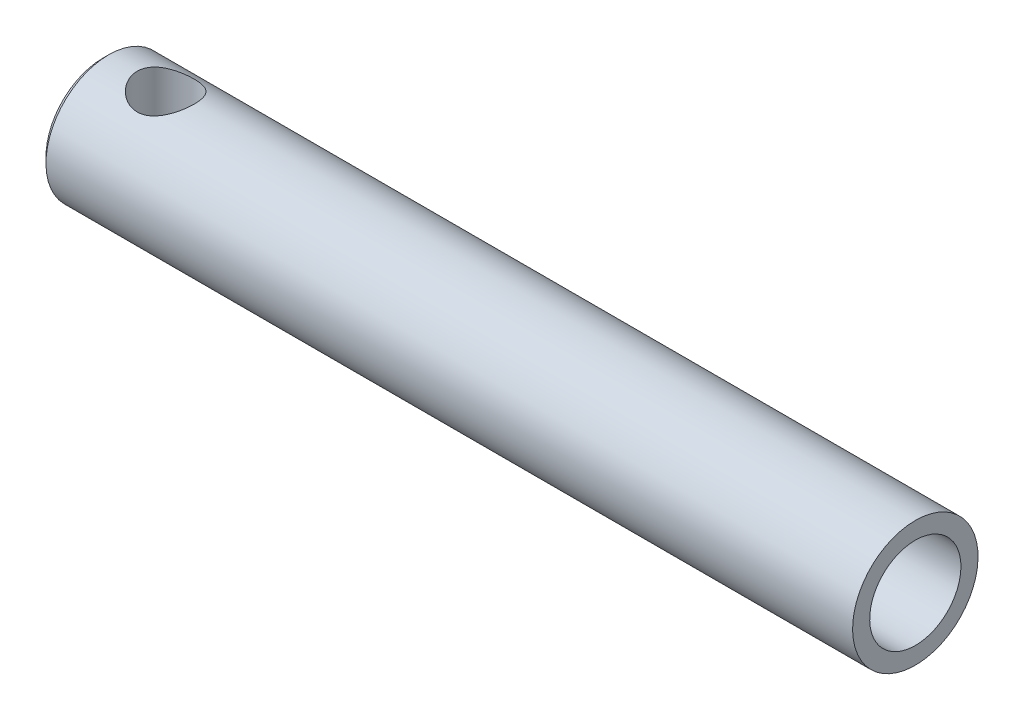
ISO-10303-21;
HEADER;
FILE_DESCRIPTION(('STEP AP214'),'2;1');
FILE_NAME('part.step','',(''),(''),'','','');
FILE_SCHEMA(('AUTOMOTIVE_DESIGN { 1 0 10303 214 1 1 1 1 }'));
ENDSEC;
DATA;
#1=APPLICATION_CONTEXT('core data for automotive mechanical design processes');
#2=APPLICATION_PROTOCOL_DEFINITION('international standard','automotive_design',2000,#1);
#3=PRODUCT_CONTEXT('',#1,'mechanical');
#4=PRODUCT('Part','Part','',(#3));
#5=PRODUCT_RELATED_PRODUCT_CATEGORY('part','',(#4));
#6=PRODUCT_DEFINITION_FORMATION('','',#4);
#7=PRODUCT_DEFINITION_CONTEXT('part definition',#1,'design');
#8=PRODUCT_DEFINITION('design','',#6,#7);
#9=PRODUCT_DEFINITION_SHAPE('','',#8);
#10=(LENGTH_UNIT() NAMED_UNIT(*) SI_UNIT(.MILLI.,.METRE.));
#11=(NAMED_UNIT(*) PLANE_ANGLE_UNIT() SI_UNIT($,.RADIAN.));
#12=(NAMED_UNIT(*) SI_UNIT($,.STERADIAN.) SOLID_ANGLE_UNIT());
#13=UNCERTAINTY_MEASURE_WITH_UNIT(LENGTH_MEASURE(1.E-05),#10,'distance_accuracy_value','');
#14=(GEOMETRIC_REPRESENTATION_CONTEXT(3) GLOBAL_UNCERTAINTY_ASSIGNED_CONTEXT((#13)) GLOBAL_UNIT_ASSIGNED_CONTEXT((#10,
#11,#12)) REPRESENTATION_CONTEXT('',''));
#15=CARTESIAN_POINT('',(0.,0.,0.));
#16=DIRECTION('',(0.,0.,1.));
#17=DIRECTION('',(1.,0.,0.));
#18=AXIS2_PLACEMENT_3D('',#15,#16,#17);
#19=CARTESIAN_POINT('',(-21.0563492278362,0.,0.));
#20=DIRECTION('',(1.,0.,0.));
#21=DIRECTION('',(0.,1.,0.));
#22=AXIS2_PLACEMENT_3D('',#19,#20,#21);
#23=CYLINDRICAL_SURFACE('',#22,5.5);
#24=CARTESIAN_POINT('',(-5.00000004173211,0.,0.));
#25=DIRECTION('',(1.,0.,0.));
#26=DIRECTION('',(0.,1.,0.));
#27=AXIS2_PLACEMENT_3D('',#24,#25,#26);
#28=CIRCLE('',#27,5.5);
#29=CARTESIAN_POINT('',(-5.00000004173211,5.5,0.));
#30=VERTEX_POINT('',#29);
#31=EDGE_CURVE('E23',#30,#30,#28,.T.);
#32=ORIENTED_EDGE('',*,*,#31,.T.);
#33=EDGE_LOOP('',(#32));
#34=FACE_BOUND('',#33,.T.);
#35=CARTESIAN_POINT('',(0.,-4.89897948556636,2.5));
#36=CARTESIAN_POINT('',(0.13201451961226,-4.89898837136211,2.49999196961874));
#37=CARTESIAN_POINT('',(0.26423901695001,-4.90439430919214,2.48947537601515));
#38=CARTESIAN_POINT('',(0.524765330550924,-4.92528154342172,2.44787943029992));
#39=CARTESIAN_POINT('',(0.653056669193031,-4.94078765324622,2.41674943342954));
#40=CARTESIAN_POINT('',(0.901476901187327,-4.97972515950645,2.33545276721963));
#41=CARTESIAN_POINT('',(1.02164042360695,-5.00312000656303,2.28537376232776));
#42=CARTESIAN_POINT('',(1.25183023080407,-5.05514370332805,2.16786451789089));
#43=CARTESIAN_POINT('',(1.36185758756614,-5.08377199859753,2.10043611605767));
#44=CARTESIAN_POINT('',(1.57689426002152,-5.14541251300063,1.9447848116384));
#45=CARTESIAN_POINT('',(1.68106246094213,-5.17859023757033,1.85546486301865));
#46=CARTESIAN_POINT('',(1.87357655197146,-5.24424327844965,1.66086013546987));
#47=CARTESIAN_POINT('',(1.96191562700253,-5.27671828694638,1.55556851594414));
#48=CARTESIAN_POINT('',(2.12485113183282,-5.33938487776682,1.32512405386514));
#49=CARTESIAN_POINT('',(2.19846269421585,-5.3693621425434,1.19921119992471));
#50=CARTESIAN_POINT('',(2.32308499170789,-5.42157820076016,0.935175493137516));
#51=CARTESIAN_POINT('',(2.37410757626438,-5.44382105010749,0.797059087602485));
#52=CARTESIAN_POINT('',(2.44893433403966,-5.47688079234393,0.521404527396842));
#53=CARTESIAN_POINT('',(2.47419949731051,-5.48830796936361,0.384337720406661));
#54=CARTESIAN_POINT('',(2.50155448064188,-5.5006923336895,0.107467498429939));
#55=CARTESIAN_POINT('',(2.5036556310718,-5.50165463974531,-0.0323345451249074));
#56=CARTESIAN_POINT('',(2.4853019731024,-5.493330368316,-0.299930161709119));
#57=CARTESIAN_POINT('',(2.46646426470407,-5.48477852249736,-0.427862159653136));
#58=CARTESIAN_POINT('',(2.40959213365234,-5.45944031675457,-0.678516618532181));
#59=CARTESIAN_POINT('',(2.37155628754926,-5.44265334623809,-0.801238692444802));
#60=CARTESIAN_POINT('',(2.27697996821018,-5.40210986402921,-1.04025925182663));
#61=CARTESIAN_POINT('',(2.22016820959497,-5.37825173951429,-1.15643244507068));
#62=CARTESIAN_POINT('',(2.08995466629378,-5.32582034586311,-1.37789997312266));
#63=CARTESIAN_POINT('',(2.016546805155,-5.29724535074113,-1.48319030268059));
#64=CARTESIAN_POINT('',(1.84830048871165,-5.23541847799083,-1.68904292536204));
#65=CARTESIAN_POINT('',(1.75220270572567,-5.20197523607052,-1.78851976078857));
#66=CARTESIAN_POINT('',(1.54476575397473,-5.13581955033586,-1.97046933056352));
#67=CARTESIAN_POINT('',(1.43341836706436,-5.10310751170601,-2.05293283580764));
#68=CARTESIAN_POINT('',(1.1923801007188,-5.04059957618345,-2.20209013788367));
#69=CARTESIAN_POINT('',(1.06208750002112,-5.01100237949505,-2.26790243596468));
#70=CARTESIAN_POINT('',(0.790579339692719,-4.9605759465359,-2.37619334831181));
#71=CARTESIAN_POINT('',(0.649373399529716,-4.93973909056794,-2.41869225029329));
#72=CARTESIAN_POINT('',(0.370943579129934,-4.91119669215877,-2.47610787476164));
#73=CARTESIAN_POINT('',(0.234175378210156,-4.90264732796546,-2.49280372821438));
#74=CARTESIAN_POINT('',(-0.0404465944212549,-4.89722669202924,-2.50344178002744));
#75=CARTESIAN_POINT('',(-0.178299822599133,-4.90034990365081,-2.49739472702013));
#76=CARTESIAN_POINT('',(-0.43913653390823,-4.91703840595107,-2.46434845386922));
#77=CARTESIAN_POINT('',(-0.562408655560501,-4.92972117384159,-2.43911853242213));
#78=CARTESIAN_POINT('',(-0.8028151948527,-4.96289406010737,-2.3708881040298));
#79=CARTESIAN_POINT('',(-0.919947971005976,-4.98338625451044,-2.32788287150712));
#80=CARTESIAN_POINT('',(-1.15073047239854,-5.03098751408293,-2.2231964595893));
#81=CARTESIAN_POINT('',(-1.26398074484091,-5.05835471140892,-2.16075614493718));
#82=CARTESIAN_POINT('',(-1.47899920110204,-5.11631673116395,-2.01968175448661));
#83=CARTESIAN_POINT('',(-1.58076181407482,-5.1469131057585,-1.94103987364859));
#84=CARTESIAN_POINT('',(-1.7805626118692,-5.21158189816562,-1.76053571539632));
#85=CARTESIAN_POINT('',(-1.87720446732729,-5.24569526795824,-1.6571358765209));
#86=CARTESIAN_POINT('',(-2.05209822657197,-5.31079182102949,-1.4348829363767));
#87=CARTESIAN_POINT('',(-2.13034698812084,-5.34177446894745,-1.31602720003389));
#88=CARTESIAN_POINT('',(-2.26679496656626,-5.39763225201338,-1.06412926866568));
#89=CARTESIAN_POINT('',(-2.3247603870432,-5.42243527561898,-0.930943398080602));
#90=CARTESIAN_POINT('',(-2.41696091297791,-5.462596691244,-0.655271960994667));
#91=CARTESIAN_POINT('',(-2.45121311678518,-5.47796188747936,-0.512793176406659));
#92=CARTESIAN_POINT('',(-2.49257517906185,-5.49660137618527,-0.234932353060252));
#93=CARTESIAN_POINT('',(-2.50164338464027,-5.50074734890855,-0.0998989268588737));
#94=CARTESIAN_POINT('',(-2.4978682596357,-5.49903067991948,0.169779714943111));
#95=CARTESIAN_POINT('',(-2.48503020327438,-5.49317044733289,0.304425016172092));
#96=CARTESIAN_POINT('',(-2.43919443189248,-5.47259382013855,0.562783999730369));
#97=CARTESIAN_POINT('',(-2.40719214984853,-5.45831522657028,0.686712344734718));
#98=CARTESIAN_POINT('',(-2.32512996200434,-5.42262556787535,0.927328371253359));
#99=CARTESIAN_POINT('',(-2.275066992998,-5.40121329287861,1.04401482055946));
#100=CARTESIAN_POINT('',(-2.15580272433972,-5.35204671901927,1.27275603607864));
#101=CARTESIAN_POINT('',(-2.08583089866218,-5.32404717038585,1.3843549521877));
#102=CARTESIAN_POINT('',(-1.92977917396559,-5.26486798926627,1.59471801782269));
#103=CARTESIAN_POINT('',(-1.84369223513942,-5.23368696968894,1.693476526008));
#104=CARTESIAN_POINT('',(-1.64951149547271,-5.16835233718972,1.88390274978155));
#105=CARTESIAN_POINT('',(-1.5401866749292,-5.13416609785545,1.9743091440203));
#106=CARTESIAN_POINT('',(-1.30709433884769,-5.06911813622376,2.13579923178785));
#107=CARTESIAN_POINT('',(-1.18331737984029,-5.03825861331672,2.20687018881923));
#108=CARTESIAN_POINT('',(-0.922931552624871,-4.98353191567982,2.32785313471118));
#109=CARTESIAN_POINT('',(-0.786228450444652,-4.95972231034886,2.37759232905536));
#110=CARTESIAN_POINT('',(-0.575599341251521,-4.93218350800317,2.43392297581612));
#111=CARTESIAN_POINT('',(-0.504529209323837,-4.92436998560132,2.4496473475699));
#112=CARTESIAN_POINT('',(-0.361045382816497,-4.91174811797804,2.47486081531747));
#113=CARTESIAN_POINT('',(-0.288632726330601,-4.90693754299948,2.48435453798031));
#114=CARTESIAN_POINT('',(-0.180023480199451,-4.90215466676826,2.49377025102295));
#115=CARTESIAN_POINT('',(-0.144070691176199,-4.9009659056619,2.49610476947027));
#116=CARTESIAN_POINT('',(-0.0720838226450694,-4.89937708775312,2.49922076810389));
#117=CARTESIAN_POINT('',(-0.0360497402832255,-4.89897705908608,2.50000219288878));
#118=CARTESIAN_POINT('',(0.,-4.89897948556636,2.5));
#119=B_SPLINE_CURVE_WITH_KNOTS('',3,(#35,#36,#37,#38,#39,#40,#41,#42,#43,#44,#45,#46,#47,#48,
#49,#50,#51,#52,#53,#54,#55,#56,#57,#58,#59,#60,#61,#62,#63,#64,#65,#66,#67,#68,#69,#70,#71,#72,
#73,#74,#75,#76,#77,#78,#79,#80,#81,#82,#83,#84,#85,#86,#87,#88,#89,#90,#91,#92,#93,#94,#95,#96,
#97,#98,#99,#100,#101,#102,#103,#104,#105,#106,#107,#108,#109,#110,#111,#112,#113,#114,#115,
#116,#117,#118),.UNSPECIFIED.,.T.,.F.,(4,2,2,2,2,2,2,2,2,2,2,2,2,2,2,2,2,2,2,2,2,2,2,2,2,2,2,2,
2,2,2,2,2,2,2,2,2,2,2,2,2,4),(0.,0.395898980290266,0.792774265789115,1.18783548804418,
1.58285488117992,2.00455964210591,2.4264455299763,2.87084384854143,3.3150087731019,
3.73227994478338,4.14934700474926,4.53631095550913,4.92330360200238,5.31615183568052,
5.70914413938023,6.13417892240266,6.55944366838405,7.00393462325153,7.44803815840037,
7.85988595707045,8.27153913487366,8.64923866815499,9.02703867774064,9.42198794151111,
9.81712791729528,10.2518845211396,10.6867153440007,11.1264048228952,11.5657769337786,
11.9698739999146,12.3738737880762,12.7585157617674,13.1432230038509,13.5455235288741,
13.9480002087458,14.3837526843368,14.8197915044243,15.2592985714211,15.4786446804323,
15.6978277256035,15.8059336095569,15.9140433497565),.UNSPECIFIED.);
#120=CARTESIAN_POINT('',(0.,-4.89897948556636,2.5));
#121=VERTEX_POINT('',#120);
#122=EDGE_CURVE('E32',#121,#121,#119,.T.);
#123=ORIENTED_EDGE('',*,*,#122,.T.);
#124=EDGE_LOOP('',(#123));
#125=FACE_BOUND('',#124,.T.);
#126=CARTESIAN_POINT('',(-2.5,5.5,0.));
#127=CARTESIAN_POINT('',(-2.49999229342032,5.49999369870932,-0.132816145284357));
#128=CARTESIAN_POINT('',(-2.48935291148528,5.49513526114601,-0.265835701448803));
#129=CARTESIAN_POINT('',(-2.44722291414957,5.47618102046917,-0.528027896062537));
#130=CARTESIAN_POINT('',(-2.41568392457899,5.46206378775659,-0.657190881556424));
#131=CARTESIAN_POINT('',(-2.33319455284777,5.42608787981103,-0.907466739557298));
#132=CARTESIAN_POINT('',(-2.28231463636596,5.40425732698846,-1.02860698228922));
#133=CARTESIAN_POINT('',(-2.16291058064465,5.35492606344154,-1.26049169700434));
#134=CARTESIAN_POINT('',(-2.09438997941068,5.32742648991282,-1.37123824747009));
#135=CARTESIAN_POINT('',(-1.93751407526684,5.26767788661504,-1.58575279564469));
#136=CARTESIAN_POINT('',(-1.84830532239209,5.23525516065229,-1.68884771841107));
#137=CARTESIAN_POINT('',(-1.65440108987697,5.16998160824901,-1.87921167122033));
#138=CARTESIAN_POINT('',(-1.54969602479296,5.1371305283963,-1.96647083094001));
#139=CARTESIAN_POINT('',(-1.3200550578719,5.07244492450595,-2.12798843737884));
#140=CARTESIAN_POINT('',(-1.19427419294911,5.040794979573,-2.20112759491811));
#141=CARTESIAN_POINT('',(-0.930567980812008,4.98491966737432,-2.32491325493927));
#142=CARTESIAN_POINT('',(-0.792650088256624,4.96068978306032,-2.37557345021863));
#143=CARTESIAN_POINT('',(-0.516304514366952,4.9243140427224,-2.45005627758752));
#144=CARTESIAN_POINT('',(-0.378308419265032,4.91158514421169,-2.47518302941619));
#145=CARTESIAN_POINT('',(-0.0995180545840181,4.89801821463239,-2.50193279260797));
#146=CARTESIAN_POINT('',(0.0412741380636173,4.89717166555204,-2.50357264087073));
#147=CARTESIAN_POINT('',(0.30741072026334,4.90698153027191,-2.48427141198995));
#148=CARTESIAN_POINT('',(0.432957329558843,4.91655818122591,-2.46545016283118));
#149=CARTESIAN_POINT('',(0.678866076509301,4.94428109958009,-2.4093676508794));
#150=CARTESIAN_POINT('',(0.799226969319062,4.96242941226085,-2.37210198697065));
#151=CARTESIAN_POINT('',(1.03463657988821,5.00567208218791,-2.27945184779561));
#152=CARTESIAN_POINT('',(1.14950198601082,5.03091516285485,-2.22367420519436));
#153=CARTESIAN_POINT('',(1.3687414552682,5.08548488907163,-2.09586859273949));
#154=CARTESIAN_POINT('',(1.47311099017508,5.11481328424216,-2.02383365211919));
#155=CARTESIAN_POINT('',(1.67964656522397,5.17789221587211,-1.85692478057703));
#156=CARTESIAN_POINT('',(1.78049273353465,5.2117880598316,-1.76046753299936));
#157=CARTESIAN_POINT('',(1.96506827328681,5.27769368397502,-1.55174815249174));
#158=CARTESIAN_POINT('',(2.04879199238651,5.30970283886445,-1.43948082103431));
#159=CARTESIAN_POINT('',(2.19920668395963,5.36950534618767,-1.19766281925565));
#160=CARTESIAN_POINT('',(2.26526247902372,5.39712978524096,-1.06767206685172));
#161=CARTESIAN_POINT('',(2.37408839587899,5.44369936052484,-0.796844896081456));
#162=CARTESIAN_POINT('',(2.41687387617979,5.46265022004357,-0.656015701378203));
#163=CARTESIAN_POINT('',(2.47495536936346,5.48860490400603,-0.37844991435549));
#164=CARTESIAN_POINT('',(2.49201639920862,5.49637394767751,-0.242154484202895));
#165=CARTESIAN_POINT('',(2.50354688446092,5.50161007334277,0.0315660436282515));
#166=CARTESIAN_POINT('',(2.49802449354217,5.49908087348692,0.168990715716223));
#167=CARTESIAN_POINT('',(2.4657141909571,5.48448407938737,0.432146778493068));
#168=CARTESIAN_POINT('',(2.44025247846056,5.47301153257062,0.558078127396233));
#169=CARTESIAN_POINT('',(2.37073267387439,5.44237110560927,0.803693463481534));
#170=CARTESIAN_POINT('',(2.32667235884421,5.42320230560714,0.923376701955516));
#171=CARTESIAN_POINT('',(2.21983025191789,5.37821815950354,1.15732747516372));
#172=CARTESIAN_POINT('',(2.15651006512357,5.35221506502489,1.27131180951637));
#173=CARTESIAN_POINT('',(2.013532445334,5.29622400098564,1.48744614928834));
#174=CARTESIAN_POINT('',(1.93386784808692,5.26623428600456,1.58959093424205));
#175=CARTESIAN_POINT('',(1.75268934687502,5.2023213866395,1.78819128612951));
#176=CARTESIAN_POINT('',(1.64990310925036,5.16827928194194,1.88345063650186));
#177=CARTESIAN_POINT('',(1.42943763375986,5.10218027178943,2.05579555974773));
#178=CARTESIAN_POINT('',(1.31175234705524,5.07012418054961,2.13287371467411));
#179=CARTESIAN_POINT('',(1.06054583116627,5.01093675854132,2.26851417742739));
#180=CARTESIAN_POINT('',(0.92667925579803,4.98396428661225,2.32651178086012));
#181=CARTESIAN_POINT('',(0.649450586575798,4.93995555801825,2.41857144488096));
#182=CARTESIAN_POINT('',(0.506098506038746,4.9229090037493,2.45265831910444));
#183=CARTESIAN_POINT('',(0.227437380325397,4.90246200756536,2.49325807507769));
#184=CARTESIAN_POINT('',(0.0925190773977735,4.89799994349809,2.5019188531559));
#185=CARTESIAN_POINT('',(-0.17683309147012,4.90032179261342,2.49737021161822));
#186=CARTESIAN_POINT('',(-0.311267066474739,4.90710299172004,2.48416607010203));
#187=CARTESIAN_POINT('',(-0.566626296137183,4.93010341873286,2.4381684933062));
#188=CARTESIAN_POINT('',(-0.687858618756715,4.94567287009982,2.40671995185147));
#189=CARTESIAN_POINT('',(-0.923292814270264,4.98386936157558,2.32658661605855));
#190=CARTESIAN_POINT('',(-1.03749261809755,5.00649846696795,2.2778967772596));
#191=CARTESIAN_POINT('',(-1.26378703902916,5.05808484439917,2.16104195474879));
#192=CARTESIAN_POINT('',(-1.37525911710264,5.08735847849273,2.09181431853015));
#193=CARTESIAN_POINT('',(-1.58566870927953,5.14822130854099,1.93719380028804));
#194=CARTESIAN_POINT('',(-1.68460066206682,5.17981152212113,1.85179378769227));
#195=CARTESIAN_POINT('',(-1.87666020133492,5.24527901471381,1.65784520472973));
#196=CARTESIAN_POINT('',(-1.96838740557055,5.27909503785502,1.54788097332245));
#197=CARTESIAN_POINT('',(-2.13226148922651,5.34236067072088,1.31300676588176));
#198=CARTESIAN_POINT('',(-2.20439929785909,5.3718082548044,1.18808990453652));
#199=CARTESIAN_POINT('',(-2.32602129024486,5.42285296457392,0.927398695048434));
#200=CARTESIAN_POINT('',(-2.3756993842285,5.44451694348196,0.791729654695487));
#201=CARTESIAN_POINT('',(-2.43218917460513,5.46948623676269,0.582817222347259));
#202=CARTESIAN_POINT('',(-2.44800908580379,5.4765522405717,0.512336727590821));
#203=CARTESIAN_POINT('',(-2.47351011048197,5.48799750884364,0.370074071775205));
#204=CARTESIAN_POINT('',(-2.48319539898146,5.49237860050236,0.298292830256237));
#205=CARTESIAN_POINT('',(-2.49316086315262,5.49689395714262,0.188612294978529));
#206=CARTESIAN_POINT('',(-2.49572386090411,5.49805724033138,0.15094640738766));
#207=CARTESIAN_POINT('',(-2.49914453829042,5.49961116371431,0.075525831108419));
#208=CARTESIAN_POINT('',(-2.50000219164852,5.50000179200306,0.037771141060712));
#209=CARTESIAN_POINT('',(-2.5,5.5,0.));
#210=B_SPLINE_CURVE_WITH_KNOTS('',3,(#126,#127,#128,#129,#130,#131,#132,#133,#134,#135,#136,
#137,#138,#139,#140,#141,#142,#143,#144,#145,#146,#147,#148,#149,#150,#151,#152,#153,#154,#155,
#156,#157,#158,#159,#160,#161,#162,#163,#164,#165,#166,#167,#168,#169,#170,#171,#172,#173,#174,
#175,#176,#177,#178,#179,#180,#181,#182,#183,#184,#185,#186,#187,#188,#189,#190,#191,#192,#193,
#194,#195,#196,#197,#198,#199,#200,#201,#202,#203,#204,#205,#206,#207,#208,#209),.UNSPECIFIED.,
.T.,.F.,(4,2,2,2,2,2,2,2,2,2,2,2,2,2,2,2,2,2,2,2,2,2,2,2,2,2,2,2,2,2,2,2,2,2,2,2,2,2,2,2,2,4),
(0.,0.398300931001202,0.797527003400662,1.19531228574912,1.59301785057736,2.01163405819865,
2.43051029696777,2.8749655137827,3.31914962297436,3.73929338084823,4.15913593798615,
4.53929253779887,4.91953989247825,5.30844370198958,5.69751458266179,6.1264236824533,
6.55547414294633,6.99833839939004,7.44091000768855,7.85145915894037,8.26186009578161,
8.64706845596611,9.03232287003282,9.42952911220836,9.8269098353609,10.2576285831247,
10.6885227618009,11.1312140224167,11.5734451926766,11.9770599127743,12.3805772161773,
12.7575667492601,13.1346666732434,13.5363493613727,13.9382095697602,14.3775242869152,
14.8170420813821,15.2526891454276,15.4701654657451,15.6874936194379,15.800763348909,
15.9140348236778),.UNSPECIFIED.);
#211=CARTESIAN_POINT('',(-2.5,5.5,0.));
#212=VERTEX_POINT('',#211);
#213=EDGE_CURVE('E28',#212,#212,#210,.T.);
#214=ORIENTED_EDGE('',*,*,#213,.T.);
#215=EDGE_LOOP('',(#214));
#216=FACE_BOUND('',#215,.T.);
#217=CARTESIAN_POINT('',(65.7399999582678,0.,0.));
#218=DIRECTION('',(1.,0.,0.));
#219=DIRECTION('',(0.,1.,0.));
#220=AXIS2_PLACEMENT_3D('',#217,#218,#219);
#221=CIRCLE('',#220,5.5);
#222=CARTESIAN_POINT('',(65.7399999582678,5.49999999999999,0.));
#223=VERTEX_POINT('',#222);
#224=EDGE_CURVE('E80',#223,#223,#221,.T.);
#225=ORIENTED_EDGE('',*,*,#224,.F.);
#226=EDGE_LOOP('',(#225));
#227=FACE_BOUND('',#226,.T.);
#228=ADVANCED_FACE('F15',(#34,#125,#216,#227),#23,.T.);
#229=CARTESIAN_POINT('',(-5.50000004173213,5.37293515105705E-07,1.69383534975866E-08));
#230=DIRECTION('',(1.,0.,0.));
#231=DIRECTION('',(0.,-1.,0.));
#232=AXIS2_PLACEMENT_3D('',#229,#230,#231);
#233=PLANE('',#232);
#234=CARTESIAN_POINT('',(-5.50000004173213,0.,0.));
#235=DIRECTION('',(1.,0.,0.));
#236=DIRECTION('',(0.,0.,-1.));
#237=AXIS2_PLACEMENT_3D('',#234,#235,#236);
#238=CIRCLE('',#237,5.);
#239=CARTESIAN_POINT('',(-5.50000004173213,0.,-5.));
#240=VERTEX_POINT('',#239);
#241=EDGE_CURVE('E10',#240,#240,#238,.F.);
#242=ORIENTED_EDGE('',*,*,#241,.T.);
#243=EDGE_LOOP('',(#242));
#244=FACE_BOUND('',#243,.T.);
#245=ADVANCED_FACE('F59',(#244),#233,.F.);
#246=CARTESIAN_POINT('',(-5.00000004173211,0.,0.));
#247=DIRECTION('',(1.,0.,0.));
#248=DIRECTION('',(0.,1.,0.));
#249=AXIS2_PLACEMENT_3D('',#246,#247,#248);
#250=CONICAL_SURFACE('',#249,5.5,0.785398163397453);
#251=ORIENTED_EDGE('',*,*,#241,.F.);
#252=EDGE_LOOP('',(#251));
#253=FACE_BOUND('',#252,.T.);
#254=ORIENTED_EDGE('',*,*,#31,.F.);
#255=EDGE_LOOP('',(#254));
#256=FACE_BOUND('',#255,.T.);
#257=ADVANCED_FACE('F17',(#253,#256),#250,.T.);
#258=CARTESIAN_POINT('',(0.,-7.,0.));
#259=DIRECTION('',(0.,1.,0.));
#260=DIRECTION('',(0.,0.,1.));
#261=AXIS2_PLACEMENT_3D('',#258,#259,#260);
#262=CYLINDRICAL_SURFACE('',#261,2.5);
#263=ORIENTED_EDGE('',*,*,#122,.F.);
#264=EDGE_LOOP('',(#263));
#265=FACE_BOUND('',#264,.T.);
#266=ORIENTED_EDGE('',*,*,#213,.F.);
#267=EDGE_LOOP('',(#266));
#268=FACE_BOUND('',#267,.T.);
#269=ADVANCED_FACE('F45',(#265,#268),#262,.F.);
#270=CARTESIAN_POINT('',(65.7399999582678,0.,0.));
#271=DIRECTION('',(1.,0.,0.));
#272=DIRECTION('',(0.,1.,0.));
#273=AXIS2_PLACEMENT_3D('',#270,#271,#272);
#274=PLANE('',#273);
#275=ORIENTED_EDGE('',*,*,#224,.T.);
#276=EDGE_LOOP('',(#275));
#277=FACE_BOUND('',#276,.T.);
#278=CARTESIAN_POINT('',(65.7399999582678,5.37293419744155E-07,1.69388530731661E-08));
#279=DIRECTION('',(1.,0.,0.));
#280=DIRECTION('',(0.,1.,0.));
#281=AXIS2_PLACEMENT_3D('',#278,#279,#280);
#282=CIRCLE('',#281,4.);
#283=CARTESIAN_POINT('',(65.7399999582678,4.00000053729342,1.69388530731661E-08));
#284=VERTEX_POINT('',#283);
#285=EDGE_CURVE('E19',#284,#284,#282,.F.);
#286=ORIENTED_EDGE('',*,*,#285,.T.);
#287=EDGE_LOOP('',(#286));
#288=FACE_BOUND('',#287,.T.);
#289=ADVANCED_FACE('F49',(#277,#288),#274,.T.);
#290=CARTESIAN_POINT('',(41.4999999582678,5.37293422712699E-07,1.69388522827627E-08));
#291=DIRECTION('',(1.,0.,0.));
#292=DIRECTION('',(0.,1.,0.));
#293=AXIS2_PLACEMENT_3D('',#290,#291,#292);
#294=PLANE('',#293);
#295=CARTESIAN_POINT('',(41.4999999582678,5.37293422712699E-07,1.69388522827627E-08));
#296=DIRECTION('',(1.,0.,0.));
#297=DIRECTION('',(0.,1.,0.));
#298=AXIS2_PLACEMENT_3D('',#295,#296,#297);
#299=CIRCLE('',#298,4.);
#300=CARTESIAN_POINT('',(41.4999999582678,4.00000053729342,1.69388522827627E-08));
#301=VERTEX_POINT('',#300);
#302=EDGE_CURVE('E39',#301,#301,#299,.T.);
#303=ORIENTED_EDGE('',*,*,#302,.T.);
#304=EDGE_LOOP('',(#303));
#305=FACE_BOUND('',#304,.T.);
#306=ADVANCED_FACE('F51',(#305),#294,.T.);
#307=CARTESIAN_POINT('',(66.4999999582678,5.37293419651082E-07,1.69388530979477E-08));
#308=DIRECTION('',(1.,0.,0.));
#309=DIRECTION('',(0.,1.,0.));
#310=AXIS2_PLACEMENT_3D('',#307,#308,#309);
#311=CYLINDRICAL_SURFACE('',#310,4.);
#312=ORIENTED_EDGE('',*,*,#302,.F.);
#313=EDGE_LOOP('',(#312));
#314=FACE_BOUND('',#313,.T.);
#315=ORIENTED_EDGE('',*,*,#285,.F.);
#316=EDGE_LOOP('',(#315));
#317=FACE_BOUND('',#316,.T.);
#318=ADVANCED_FACE('F55',(#314,#317),#311,.F.);
#319=CLOSED_SHELL('',(#228,#245,#257,#269,#289,#306,#318));
#320=MANIFOLD_SOLID_BREP('B1',#319);
#321=ADVANCED_BREP_SHAPE_REPRESENTATION('',(#18,#320),#14);
#322=SHAPE_DEFINITION_REPRESENTATION(#9,#321);
ENDSEC;
END-ISO-10303-21;
